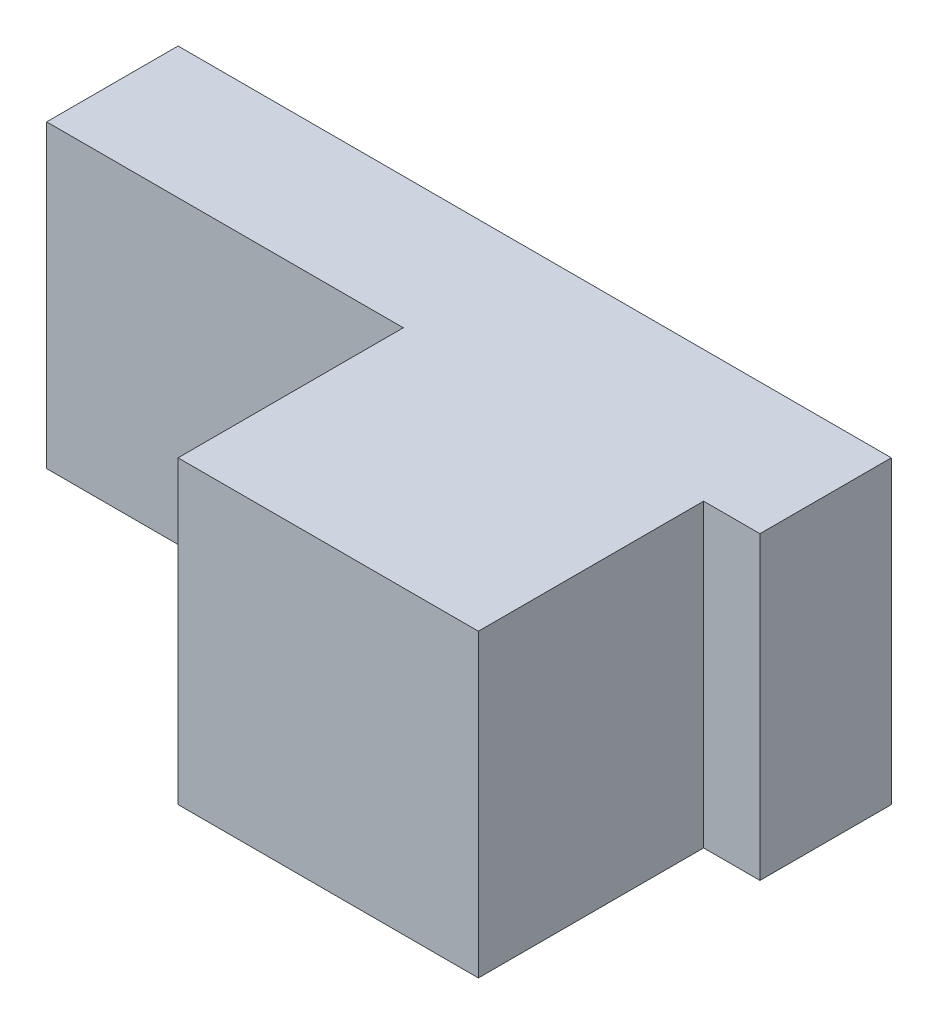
from build123d import *

# Parameters (mm, degrees)
ESQUISSE1_W      = 19
ESQUISSE1_H      = 8
EXTRUSION1_DEPTH = 3.5
ESQUISSE2_W      = 8
ESQUISSE2_H      = 8
EXTRUSION2_DEPTH = 6


with BuildPart() as part:
    # Esquisse1 → Extrusion1 (new body)
    with BuildSketch(Plane.XY):
        Rectangle(ESQUISSE1_W, ESQUISSE1_H)
    extrude(amount=EXTRUSION1_DEPTH)

    # Esquisse2 → Extrusion2 (add)
    with BuildSketch(Plane.XY.offset(3.5)):
        with Locations((4, 0)):
            Rectangle(ESQUISSE2_W, ESQUISSE2_H)
    extrude(amount=EXTRUSION2_DEPTH)


solid = part.part
